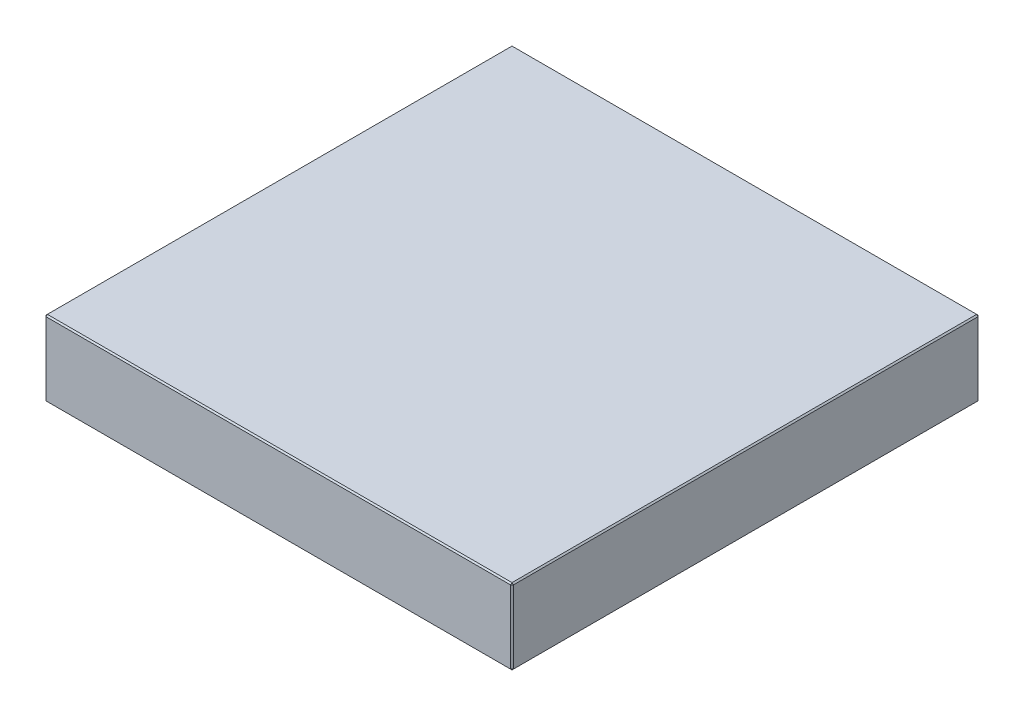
ISO-10303-21;
HEADER;
FILE_DESCRIPTION(('STEP AP214'),'2;1');
FILE_NAME('part.step','',(''),(''),'','','');
FILE_SCHEMA(('AUTOMOTIVE_DESIGN { 1 0 10303 214 1 1 1 1 }'));
ENDSEC;
DATA;
#1=APPLICATION_CONTEXT('core data for automotive mechanical design processes');
#2=APPLICATION_PROTOCOL_DEFINITION('international standard','automotive_design',2000,#1);
#3=PRODUCT_CONTEXT('',#1,'mechanical');
#4=PRODUCT('Part','Part','',(#3));
#5=PRODUCT_RELATED_PRODUCT_CATEGORY('part','',(#4));
#6=PRODUCT_DEFINITION_FORMATION('','',#4);
#7=PRODUCT_DEFINITION_CONTEXT('part definition',#1,'design');
#8=PRODUCT_DEFINITION('design','',#6,#7);
#9=PRODUCT_DEFINITION_SHAPE('','',#8);
#10=(LENGTH_UNIT() NAMED_UNIT(*) SI_UNIT(.MILLI.,.METRE.));
#11=(NAMED_UNIT(*) PLANE_ANGLE_UNIT() SI_UNIT($,.RADIAN.));
#12=(NAMED_UNIT(*) SI_UNIT($,.STERADIAN.) SOLID_ANGLE_UNIT());
#13=UNCERTAINTY_MEASURE_WITH_UNIT(LENGTH_MEASURE(1.E-05),#10,'distance_accuracy_value','');
#14=(GEOMETRIC_REPRESENTATION_CONTEXT(3) GLOBAL_UNCERTAINTY_ASSIGNED_CONTEXT((#13)) GLOBAL_UNIT_ASSIGNED_CONTEXT((#10,
#11,#12)) REPRESENTATION_CONTEXT('',''));
#15=CARTESIAN_POINT('',(0.,0.,0.));
#16=DIRECTION('',(0.,0.,1.));
#17=DIRECTION('',(1.,0.,0.));
#18=AXIS2_PLACEMENT_3D('',#15,#16,#17);
#19=CARTESIAN_POINT('',(-173.,56.,173.));
#20=DIRECTION('',(1.,0.,0.));
#21=DIRECTION('',(0.,0.,-1.));
#22=AXIS2_PLACEMENT_3D('',#19,#20,#21);
#23=PLANE('',#22);
#24=DIRECTION('',(0.,-1.,0.));
#25=VECTOR('',#24,1.);
#26=CARTESIAN_POINT('',(-173.,56.,-172.));
#27=LINE('',#26,#25);
#28=CARTESIAN_POINT('',(-173.,55.,-172.));
#29=VERTEX_POINT('',#28);
#30=CARTESIAN_POINT('',(-173.,1.,-172.));
#31=VERTEX_POINT('',#30);
#32=EDGE_CURVE('E114',#29,#31,#27,.T.);
#33=ORIENTED_EDGE('',*,*,#32,.T.);
#34=DIRECTION('',(0.,0.,1.));
#35=VECTOR('',#34,1.);
#36=CARTESIAN_POINT('',(-173.,1.,173.));
#37=LINE('',#36,#35);
#38=CARTESIAN_POINT('',(-173.,1.,172.));
#39=VERTEX_POINT('',#38);
#40=EDGE_CURVE('E110',#31,#39,#37,.T.);
#41=ORIENTED_EDGE('',*,*,#40,.T.);
#42=DIRECTION('',(0.,1.,0.));
#43=VECTOR('',#42,1.);
#44=CARTESIAN_POINT('',(-173.,56.,172.));
#45=LINE('',#44,#43);
#46=CARTESIAN_POINT('',(-173.,55.,172.));
#47=VERTEX_POINT('',#46);
#48=EDGE_CURVE('E103',#39,#47,#45,.T.);
#49=ORIENTED_EDGE('',*,*,#48,.T.);
#50=DIRECTION('',(0.,0.,-1.));
#51=VECTOR('',#50,1.);
#52=CARTESIAN_POINT('',(-173.,55.,-173.));
#53=LINE('',#52,#51);
#54=EDGE_CURVE('E107',#47,#29,#53,.T.);
#55=ORIENTED_EDGE('',*,*,#54,.T.);
#56=EDGE_LOOP('',(#33,#41,#49,#55));
#57=FACE_BOUND('',#56,.T.);
#58=ADVANCED_FACE('F15',(#57),#23,.F.);
#59=CARTESIAN_POINT('',(173.,56.,173.));
#60=DIRECTION('',(0.,0.,-1.));
#61=DIRECTION('',(-1.,0.,0.));
#62=AXIS2_PLACEMENT_3D('',#59,#60,#61);
#63=PLANE('',#62);
#64=DIRECTION('',(-1.,0.,0.));
#65=VECTOR('',#64,1.);
#66=CARTESIAN_POINT('',(-173.,55.,173.));
#67=LINE('',#66,#65);
#68=CARTESIAN_POINT('',(172.,55.,173.));
#69=VERTEX_POINT('',#68);
#70=CARTESIAN_POINT('',(-172.,55.,173.));
#71=VERTEX_POINT('',#70);
#72=EDGE_CURVE('E164',#69,#71,#67,.T.);
#73=ORIENTED_EDGE('',*,*,#72,.T.);
#74=DIRECTION('',(0.,-1.,0.));
#75=VECTOR('',#74,1.);
#76=CARTESIAN_POINT('',(-172.,56.,173.));
#77=LINE('',#76,#75);
#78=CARTESIAN_POINT('',(-172.,1.,173.));
#79=VERTEX_POINT('',#78);
#80=EDGE_CURVE('E122',#71,#79,#77,.T.);
#81=ORIENTED_EDGE('',*,*,#80,.T.);
#82=DIRECTION('',(1.,0.,0.));
#83=VECTOR('',#82,1.);
#84=CARTESIAN_POINT('',(173.,1.,173.));
#85=LINE('',#84,#83);
#86=CARTESIAN_POINT('',(172.,1.,173.));
#87=VERTEX_POINT('',#86);
#88=EDGE_CURVE('E168',#79,#87,#85,.T.);
#89=ORIENTED_EDGE('',*,*,#88,.T.);
#90=DIRECTION('',(0.,1.,0.));
#91=VECTOR('',#90,1.);
#92=CARTESIAN_POINT('',(172.,56.,173.));
#93=LINE('',#92,#91);
#94=EDGE_CURVE('E166',#87,#69,#93,.T.);
#95=ORIENTED_EDGE('',*,*,#94,.T.);
#96=EDGE_LOOP('',(#73,#81,#89,#95));
#97=FACE_BOUND('',#96,.T.);
#98=ADVANCED_FACE('F275',(#97),#63,.F.);
#99=CARTESIAN_POINT('',(173.,56.,173.));
#100=DIRECTION('',(-1.,0.,0.));
#101=DIRECTION('',(0.,0.,1.));
#102=AXIS2_PLACEMENT_3D('',#99,#100,#101);
#103=PLANE('',#102);
#104=DIRECTION('',(0.,0.,-1.));
#105=VECTOR('',#104,1.);
#106=CARTESIAN_POINT('',(173.,1.,173.));
#107=LINE('',#106,#105);
#108=CARTESIAN_POINT('',(173.,1.,172.));
#109=VERTEX_POINT('',#108);
#110=CARTESIAN_POINT('',(173.,1.,-172.));
#111=VERTEX_POINT('',#110);
#112=EDGE_CURVE('E159',#109,#111,#107,.T.);
#113=ORIENTED_EDGE('',*,*,#112,.T.);
#114=DIRECTION('',(0.,1.,0.));
#115=VECTOR('',#114,1.);
#116=CARTESIAN_POINT('',(173.,56.,-172.));
#117=LINE('',#116,#115);
#118=CARTESIAN_POINT('',(173.,55.,-172.));
#119=VERTEX_POINT('',#118);
#120=EDGE_CURVE('E161',#111,#119,#117,.T.);
#121=ORIENTED_EDGE('',*,*,#120,.T.);
#122=DIRECTION('',(0.,0.,1.));
#123=VECTOR('',#122,1.);
#124=CARTESIAN_POINT('',(173.,55.,173.));
#125=LINE('',#124,#123);
#126=CARTESIAN_POINT('',(173.,55.,172.));
#127=VERTEX_POINT('',#126);
#128=EDGE_CURVE('E155',#119,#127,#125,.T.);
#129=ORIENTED_EDGE('',*,*,#128,.T.);
#130=DIRECTION('',(0.,-1.,0.));
#131=VECTOR('',#130,1.);
#132=CARTESIAN_POINT('',(173.,56.,172.));
#133=LINE('',#132,#131);
#134=EDGE_CURVE('E157',#127,#109,#133,.T.);
#135=ORIENTED_EDGE('',*,*,#134,.T.);
#136=EDGE_LOOP('',(#113,#121,#129,#135));
#137=FACE_BOUND('',#136,.T.);
#138=ADVANCED_FACE('F254',(#137),#103,.F.);
#139=CARTESIAN_POINT('',(173.,56.,-173.));
#140=DIRECTION('',(0.,0.,1.));
#141=DIRECTION('',(1.,0.,0.));
#142=AXIS2_PLACEMENT_3D('',#139,#140,#141);
#143=PLANE('',#142);
#144=DIRECTION('',(0.,-1.,0.));
#145=VECTOR('',#144,1.);
#146=CARTESIAN_POINT('',(172.,56.,-173.));
#147=LINE('',#146,#145);
#148=CARTESIAN_POINT('',(172.,55.,-173.));
#149=VERTEX_POINT('',#148);
#150=CARTESIAN_POINT('',(172.,1.,-173.));
#151=VERTEX_POINT('',#150);
#152=EDGE_CURVE('E148',#149,#151,#147,.T.);
#153=ORIENTED_EDGE('',*,*,#152,.T.);
#154=DIRECTION('',(-1.,0.,0.));
#155=VECTOR('',#154,1.);
#156=CARTESIAN_POINT('',(173.,1.,-173.));
#157=LINE('',#156,#155);
#158=CARTESIAN_POINT('',(-172.,1.,-173.));
#159=VERTEX_POINT('',#158);
#160=EDGE_CURVE('E153',#151,#159,#157,.T.);
#161=ORIENTED_EDGE('',*,*,#160,.T.);
#162=DIRECTION('',(0.,1.,0.));
#163=VECTOR('',#162,1.);
#164=CARTESIAN_POINT('',(-172.,56.,-173.));
#165=LINE('',#164,#163);
#166=CARTESIAN_POINT('',(-172.,55.,-173.));
#167=VERTEX_POINT('',#166);
#168=EDGE_CURVE('E150',#159,#167,#165,.T.);
#169=ORIENTED_EDGE('',*,*,#168,.T.);
#170=DIRECTION('',(1.,0.,0.));
#171=VECTOR('',#170,1.);
#172=CARTESIAN_POINT('',(173.,55.,-173.));
#173=LINE('',#172,#171);
#174=EDGE_CURVE('E146',#167,#149,#173,.T.);
#175=ORIENTED_EDGE('',*,*,#174,.T.);
#176=EDGE_LOOP('',(#153,#161,#169,#175));
#177=FACE_BOUND('',#176,.T.);
#178=ADVANCED_FACE('F284',(#177),#143,.F.);
#179=CARTESIAN_POINT('',(0.,56.,0.));
#180=DIRECTION('',(0.,1.,0.));
#181=DIRECTION('',(0.,0.,1.));
#182=AXIS2_PLACEMENT_3D('',#179,#180,#181);
#183=PLANE('',#182);
#184=DIRECTION('',(0.,0.,-1.));
#185=VECTOR('',#184,1.);
#186=CARTESIAN_POINT('',(172.,56.,-173.));
#187=LINE('',#186,#185);
#188=CARTESIAN_POINT('',(172.,56.,172.));
#189=VERTEX_POINT('',#188);
#190=CARTESIAN_POINT('',(172.,56.,-172.));
#191=VERTEX_POINT('',#190);
#192=EDGE_CURVE('E24',#189,#191,#187,.T.);
#193=ORIENTED_EDGE('',*,*,#192,.T.);
#194=DIRECTION('',(-1.,0.,0.));
#195=VECTOR('',#194,1.);
#196=CARTESIAN_POINT('',(-173.,56.,-172.));
#197=LINE('',#196,#195);
#198=CARTESIAN_POINT('',(-172.,56.,-172.));
#199=VERTEX_POINT('',#198);
#200=EDGE_CURVE('E9',#191,#199,#197,.T.);
#201=ORIENTED_EDGE('',*,*,#200,.T.);
#202=DIRECTION('',(0.,0.,1.));
#203=VECTOR('',#202,1.);
#204=CARTESIAN_POINT('',(-172.,56.,173.));
#205=LINE('',#204,#203);
#206=CARTESIAN_POINT('',(-172.,56.,172.));
#207=VERTEX_POINT('',#206);
#208=EDGE_CURVE('E180',#199,#207,#205,.T.);
#209=ORIENTED_EDGE('',*,*,#208,.T.);
#210=DIRECTION('',(1.,0.,0.));
#211=VECTOR('',#210,1.);
#212=CARTESIAN_POINT('',(173.,56.,172.));
#213=LINE('',#212,#211);
#214=EDGE_CURVE('E35',#207,#189,#213,.T.);
#215=ORIENTED_EDGE('',*,*,#214,.T.);
#216=EDGE_LOOP('',(#193,#201,#209,#215));
#217=FACE_BOUND('',#216,.T.);
#218=ADVANCED_FACE('F350',(#217),#183,.T.);
#219=CARTESIAN_POINT('',(0.,0.,0.));
#220=DIRECTION('',(0.,1.,0.));
#221=DIRECTION('',(0.,0.,1.));
#222=AXIS2_PLACEMENT_3D('',#219,#220,#221);
#223=PLANE('',#222);
#224=DIRECTION('',(0.,0.,1.));
#225=VECTOR('',#224,1.);
#226=CARTESIAN_POINT('',(172.,0.,0.));
#227=LINE('',#226,#225);
#228=CARTESIAN_POINT('',(172.,0.,-172.));
#229=VERTEX_POINT('',#228);
#230=CARTESIAN_POINT('',(172.,0.,172.));
#231=VERTEX_POINT('',#230);
#232=EDGE_CURVE('E171',#229,#231,#227,.T.);
#233=ORIENTED_EDGE('',*,*,#232,.T.);
#234=DIRECTION('',(-1.,0.,0.));
#235=VECTOR('',#234,1.);
#236=CARTESIAN_POINT('',(0.,0.,172.));
#237=LINE('',#236,#235);
#238=CARTESIAN_POINT('',(-172.,0.,172.));
#239=VERTEX_POINT('',#238);
#240=EDGE_CURVE('E177',#231,#239,#237,.T.);
#241=ORIENTED_EDGE('',*,*,#240,.T.);
#242=DIRECTION('',(0.,0.,-1.));
#243=VECTOR('',#242,1.);
#244=CARTESIAN_POINT('',(-172.,0.,0.));
#245=LINE('',#244,#243);
#246=CARTESIAN_POINT('',(-172.,0.,-172.));
#247=VERTEX_POINT('',#246);
#248=EDGE_CURVE('E175',#239,#247,#245,.T.);
#249=ORIENTED_EDGE('',*,*,#248,.T.);
#250=DIRECTION('',(1.,0.,0.));
#251=VECTOR('',#250,1.);
#252=CARTESIAN_POINT('',(0.,0.,-172.));
#253=LINE('',#252,#251);
#254=EDGE_CURVE('E173',#247,#229,#253,.T.);
#255=ORIENTED_EDGE('',*,*,#254,.T.);
#256=EDGE_LOOP('',(#233,#241,#249,#255));
#257=FACE_BOUND('',#256,.T.);
#258=ADVANCED_FACE('F246',(#257),#223,.F.);
#259=CARTESIAN_POINT('',(173.,56.,172.));
#260=DIRECTION('',(-0.707106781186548,0.,-0.707106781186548));
#261=DIRECTION('',(0.,-1.,0.));
#262=AXIS2_PLACEMENT_3D('',#259,#260,#261);
#263=PLANE('',#262);
#264=DIRECTION('',(-0.707106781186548,0.,0.707106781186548));
#265=VECTOR('',#264,1.);
#266=CARTESIAN_POINT('',(172.,55.,173.));
#267=LINE('',#266,#265);
#268=EDGE_CURVE('E19',#69,#127,#267,.F.);
#269=ORIENTED_EDGE('',*,*,#268,.F.);
#270=ORIENTED_EDGE('',*,*,#94,.F.);
#271=DIRECTION('',(0.707106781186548,0.,-0.707106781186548));
#272=VECTOR('',#271,1.);
#273=CARTESIAN_POINT('',(172.,1.,173.));
#274=LINE('',#273,#272);
#275=EDGE_CURVE('E142',#109,#87,#274,.F.);
#276=ORIENTED_EDGE('',*,*,#275,.F.);
#277=ORIENTED_EDGE('',*,*,#134,.F.);
#278=EDGE_LOOP('',(#269,#270,#276,#277));
#279=FACE_BOUND('',#278,.T.);
#280=ADVANCED_FACE('F17',(#279),#263,.F.);
#281=CARTESIAN_POINT('',(172.,55.,173.));
#282=DIRECTION('',(0.577350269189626,0.577350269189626,0.577350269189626));
#283=DIRECTION('',(0.707106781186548,0.,-0.707106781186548));
#284=AXIS2_PLACEMENT_3D('',#281,#282,#283);
#285=PLANE('',#284);
#286=DIRECTION('',(0.,-0.707106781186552,0.707106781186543));
#287=VECTOR('',#286,1.);
#288=CARTESIAN_POINT('',(172.,55.,173.));
#289=LINE('',#288,#287);
#290=EDGE_CURVE('E226',#69,#189,#289,.F.);
#291=ORIENTED_EDGE('',*,*,#290,.F.);
#292=ORIENTED_EDGE('',*,*,#268,.T.);
#293=DIRECTION('',(-0.707106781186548,0.707106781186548,0.));
#294=VECTOR('',#293,1.);
#295=CARTESIAN_POINT('',(172.5,55.5,172.));
#296=LINE('',#295,#294);
#297=EDGE_CURVE('E228',#189,#127,#296,.F.);
#298=ORIENTED_EDGE('',*,*,#297,.F.);
#299=EDGE_LOOP('',(#291,#292,#298));
#300=FACE_BOUND('',#299,.T.);
#301=ADVANCED_FACE('F270',(#300),#285,.T.);
#302=CARTESIAN_POINT('',(172.,1.,173.));
#303=DIRECTION('',(0.577350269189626,-0.577350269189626,0.577350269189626));
#304=DIRECTION('',(0.707106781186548,0.,-0.707106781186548));
#305=AXIS2_PLACEMENT_3D('',#302,#303,#304);
#306=PLANE('',#305);
#307=DIRECTION('',(-0.707106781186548,-0.707106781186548,0.));
#308=VECTOR('',#307,1.);
#309=CARTESIAN_POINT('',(172.5,0.5,172.));
#310=LINE('',#309,#308);
#311=EDGE_CURVE('E220',#109,#231,#310,.T.);
#312=ORIENTED_EDGE('',*,*,#311,.F.);
#313=ORIENTED_EDGE('',*,*,#275,.T.);
#314=DIRECTION('',(0.,0.707106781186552,0.707106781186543));
#315=VECTOR('',#314,1.);
#316=CARTESIAN_POINT('',(172.,1.,173.));
#317=LINE('',#316,#315);
#318=EDGE_CURVE('E223',#231,#87,#317,.T.);
#319=ORIENTED_EDGE('',*,*,#318,.F.);
#320=EDGE_LOOP('',(#312,#313,#319));
#321=FACE_BOUND('',#320,.T.);
#322=ADVANCED_FACE('F235',(#321),#306,.T.);
#323=CARTESIAN_POINT('',(172.,56.,0.));
#324=DIRECTION('',(0.707106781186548,0.707106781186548,0.));
#325=DIRECTION('',(0.,0.,1.));
#326=AXIS2_PLACEMENT_3D('',#323,#324,#325);
#327=PLANE('',#326);
#328=ORIENTED_EDGE('',*,*,#297,.T.);
#329=ORIENTED_EDGE('',*,*,#128,.F.);
#330=DIRECTION('',(0.707106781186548,-0.707106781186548,0.));
#331=VECTOR('',#330,1.);
#332=CARTESIAN_POINT('',(173.,55.,-172.));
#333=LINE('',#332,#331);
#334=EDGE_CURVE('E215',#191,#119,#333,.T.);
#335=ORIENTED_EDGE('',*,*,#334,.F.);
#336=ORIENTED_EDGE('',*,*,#192,.F.);
#337=EDGE_LOOP('',(#328,#329,#335,#336));
#338=FACE_BOUND('',#337,.T.);
#339=ADVANCED_FACE('F265',(#338),#327,.T.);
#340=CARTESIAN_POINT('',(0.,56.,172.));
#341=DIRECTION('',(0.,0.707106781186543,0.707106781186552));
#342=DIRECTION('',(-1.,0.,0.));
#343=AXIS2_PLACEMENT_3D('',#340,#341,#342);
#344=PLANE('',#343);
#345=ORIENTED_EDGE('',*,*,#290,.T.);
#346=ORIENTED_EDGE('',*,*,#214,.F.);
#347=DIRECTION('',(0.,0.707106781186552,-0.707106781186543));
#348=VECTOR('',#347,1.);
#349=CARTESIAN_POINT('',(-172.,55.5,172.5));
#350=LINE('',#349,#348);
#351=EDGE_CURVE('E126',#71,#207,#350,.T.);
#352=ORIENTED_EDGE('',*,*,#351,.F.);
#353=ORIENTED_EDGE('',*,*,#72,.F.);
#354=EDGE_LOOP('',(#345,#346,#352,#353));
#355=FACE_BOUND('',#354,.T.);
#356=ADVANCED_FACE('F273',(#355),#344,.T.);
#357=CARTESIAN_POINT('',(-172.,56.,173.));
#358=DIRECTION('',(0.707106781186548,0.,-0.707106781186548));
#359=DIRECTION('',(0.,-1.,0.));
#360=AXIS2_PLACEMENT_3D('',#357,#358,#359);
#361=PLANE('',#360);
#362=DIRECTION('',(0.707106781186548,0.,0.707106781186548));
#363=VECTOR('',#362,1.);
#364=CARTESIAN_POINT('',(-172.,1.,173.));
#365=LINE('',#364,#363);
#366=EDGE_CURVE('E127',#79,#39,#365,.F.);
#367=ORIENTED_EDGE('',*,*,#366,.F.);
#368=ORIENTED_EDGE('',*,*,#80,.F.);
#369=DIRECTION('',(-0.707106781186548,0.,-0.707106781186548));
#370=VECTOR('',#369,1.);
#371=CARTESIAN_POINT('',(-173.,55.,172.));
#372=LINE('',#371,#370);
#373=EDGE_CURVE('E118',#47,#71,#372,.F.);
#374=ORIENTED_EDGE('',*,*,#373,.F.);
#375=ORIENTED_EDGE('',*,*,#48,.F.);
#376=EDGE_LOOP('',(#367,#368,#374,#375));
#377=FACE_BOUND('',#376,.T.);
#378=ADVANCED_FACE('F120',(#377),#361,.F.);
#379=CARTESIAN_POINT('',(173.,1.,173.));
#380=DIRECTION('',(0.,0.707106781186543,-0.707106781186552));
#381=DIRECTION('',(1.,0.,0.));
#382=AXIS2_PLACEMENT_3D('',#379,#380,#381);
#383=PLANE('',#382);
#384=ORIENTED_EDGE('',*,*,#318,.T.);
#385=ORIENTED_EDGE('',*,*,#88,.F.);
#386=DIRECTION('',(0.,-0.707106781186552,-0.707106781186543));
#387=VECTOR('',#386,1.);
#388=CARTESIAN_POINT('',(-172.,1.,173.));
#389=LINE('',#388,#387);
#390=EDGE_CURVE('E211',#239,#79,#389,.F.);
#391=ORIENTED_EDGE('',*,*,#390,.F.);
#392=ORIENTED_EDGE('',*,*,#240,.F.);
#393=EDGE_LOOP('',(#384,#385,#391,#392));
#394=FACE_BOUND('',#393,.T.);
#395=ADVANCED_FACE('F243',(#394),#383,.F.);
#396=CARTESIAN_POINT('',(173.,1.,173.));
#397=DIRECTION('',(-0.707106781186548,0.707106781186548,0.));
#398=DIRECTION('',(0.,0.,-1.));
#399=AXIS2_PLACEMENT_3D('',#396,#397,#398);
#400=PLANE('',#399);
#401=ORIENTED_EDGE('',*,*,#311,.T.);
#402=ORIENTED_EDGE('',*,*,#232,.F.);
#403=DIRECTION('',(0.707106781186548,0.707106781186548,0.));
#404=VECTOR('',#403,1.);
#405=CARTESIAN_POINT('',(172.5,0.499999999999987,-172.));
#406=LINE('',#405,#404);
#407=EDGE_CURVE('E208',#111,#229,#406,.F.);
#408=ORIENTED_EDGE('',*,*,#407,.F.);
#409=ORIENTED_EDGE('',*,*,#112,.F.);
#410=EDGE_LOOP('',(#401,#402,#408,#409));
#411=FACE_BOUND('',#410,.T.);
#412=ADVANCED_FACE('F251',(#411),#400,.F.);
#413=CARTESIAN_POINT('',(172.,56.,-173.));
#414=DIRECTION('',(-0.707106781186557,0.,0.707106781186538));
#415=DIRECTION('',(0.,-1.,0.));
#416=AXIS2_PLACEMENT_3D('',#413,#414,#415);
#417=PLANE('',#416);
#418=DIRECTION('',(0.707106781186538,0.,0.707106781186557));
#419=VECTOR('',#418,1.);
#420=CARTESIAN_POINT('',(173.,55.,-172.));
#421=LINE('',#420,#419);
#422=EDGE_CURVE('E217',#119,#149,#421,.F.);
#423=ORIENTED_EDGE('',*,*,#422,.F.);
#424=ORIENTED_EDGE('',*,*,#120,.F.);
#425=DIRECTION('',(-0.707106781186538,0.,-0.707106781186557));
#426=VECTOR('',#425,1.);
#427=CARTESIAN_POINT('',(172.,1.,-173.));
#428=LINE('',#427,#426);
#429=EDGE_CURVE('E205',#151,#111,#428,.F.);
#430=ORIENTED_EDGE('',*,*,#429,.F.);
#431=ORIENTED_EDGE('',*,*,#152,.F.);
#432=EDGE_LOOP('',(#423,#424,#430,#431));
#433=FACE_BOUND('',#432,.T.);
#434=ADVANCED_FACE('F258',(#433),#417,.F.);
#435=CARTESIAN_POINT('',(173.,55.,-172.));
#436=DIRECTION('',(0.577350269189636,0.57735026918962,-0.57735026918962));
#437=DIRECTION('',(-0.707106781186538,0.,-0.707106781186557));
#438=AXIS2_PLACEMENT_3D('',#435,#436,#437);
#439=PLANE('',#438);
#440=ORIENTED_EDGE('',*,*,#334,.T.);
#441=ORIENTED_EDGE('',*,*,#422,.T.);
#442=DIRECTION('',(0.,0.707106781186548,0.707106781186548));
#443=VECTOR('',#442,1.);
#444=CARTESIAN_POINT('',(172.,55.5,-172.5));
#445=LINE('',#444,#443);
#446=EDGE_CURVE('E134',#191,#149,#445,.F.);
#447=ORIENTED_EDGE('',*,*,#446,.F.);
#448=EDGE_LOOP('',(#440,#441,#447));
#449=FACE_BOUND('',#448,.T.);
#450=ADVANCED_FACE('F325',(#449),#439,.T.);
#451=CARTESIAN_POINT('',(-173.,55.,172.));
#452=DIRECTION('',(-0.577350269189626,0.577350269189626,0.577350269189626));
#453=DIRECTION('',(0.707106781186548,0.,0.707106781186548));
#454=AXIS2_PLACEMENT_3D('',#451,#452,#453);
#455=PLANE('',#454);
#456=ORIENTED_EDGE('',*,*,#373,.T.);
#457=ORIENTED_EDGE('',*,*,#351,.T.);
#458=DIRECTION('',(-0.707106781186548,-0.707106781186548,0.));
#459=VECTOR('',#458,1.);
#460=CARTESIAN_POINT('',(-173.,55.,172.));
#461=LINE('',#460,#459);
#462=EDGE_CURVE('E130',#47,#207,#461,.F.);
#463=ORIENTED_EDGE('',*,*,#462,.F.);
#464=EDGE_LOOP('',(#456,#457,#463));
#465=FACE_BOUND('',#464,.T.);
#466=ADVANCED_FACE('F131',(#465),#455,.T.);
#467=CARTESIAN_POINT('',(-172.,1.,173.));
#468=DIRECTION('',(-0.577350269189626,-0.577350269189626,0.577350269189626));
#469=DIRECTION('',(0.707106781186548,0.,0.707106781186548));
#470=AXIS2_PLACEMENT_3D('',#467,#468,#469);
#471=PLANE('',#470);
#472=ORIENTED_EDGE('',*,*,#390,.T.);
#473=ORIENTED_EDGE('',*,*,#366,.T.);
#474=DIRECTION('',(-0.707106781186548,0.707106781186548,0.));
#475=VECTOR('',#474,1.);
#476=CARTESIAN_POINT('',(-172.5,0.5,172.));
#477=LINE('',#476,#475);
#478=EDGE_CURVE('E135',#239,#39,#477,.T.);
#479=ORIENTED_EDGE('',*,*,#478,.F.);
#480=EDGE_LOOP('',(#472,#473,#479));
#481=FACE_BOUND('',#480,.T.);
#482=ADVANCED_FACE('F318',(#481),#471,.T.);
#483=CARTESIAN_POINT('',(172.,1.,-173.));
#484=DIRECTION('',(0.577350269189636,-0.57735026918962,-0.57735026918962));
#485=DIRECTION('',(-0.707106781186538,0.,-0.707106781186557));
#486=AXIS2_PLACEMENT_3D('',#483,#484,#485);
#487=PLANE('',#486);
#488=ORIENTED_EDGE('',*,*,#429,.T.);
#489=ORIENTED_EDGE('',*,*,#407,.T.);
#490=DIRECTION('',(0.,-0.707106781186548,0.707106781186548));
#491=VECTOR('',#490,1.);
#492=CARTESIAN_POINT('',(172.,1.,-173.));
#493=LINE('',#492,#491);
#494=EDGE_CURVE('E198',#151,#229,#493,.T.);
#495=ORIENTED_EDGE('',*,*,#494,.F.);
#496=EDGE_LOOP('',(#488,#489,#495));
#497=FACE_BOUND('',#496,.T.);
#498=ADVANCED_FACE('F314',(#497),#487,.T.);
#499=CARTESIAN_POINT('',(0.,56.,-172.));
#500=DIRECTION('',(0.,0.707106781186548,-0.707106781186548));
#501=DIRECTION('',(1.,0.,0.));
#502=AXIS2_PLACEMENT_3D('',#499,#500,#501);
#503=PLANE('',#502);
#504=ORIENTED_EDGE('',*,*,#446,.T.);
#505=ORIENTED_EDGE('',*,*,#174,.F.);
#506=DIRECTION('',(0.,-0.707106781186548,-0.707106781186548));
#507=VECTOR('',#506,1.);
#508=CARTESIAN_POINT('',(-172.,55.,-173.));
#509=LINE('',#508,#507);
#510=EDGE_CURVE('E195',#199,#167,#509,.T.);
#511=ORIENTED_EDGE('',*,*,#510,.F.);
#512=ORIENTED_EDGE('',*,*,#200,.F.);
#513=EDGE_LOOP('',(#504,#505,#511,#512));
#514=FACE_BOUND('',#513,.T.);
#515=ADVANCED_FACE('F311',(#514),#503,.T.);
#516=CARTESIAN_POINT('',(-172.,56.,0.));
#517=DIRECTION('',(-0.707106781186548,0.707106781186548,0.));
#518=DIRECTION('',(0.,0.,-1.));
#519=AXIS2_PLACEMENT_3D('',#516,#517,#518);
#520=PLANE('',#519);
#521=ORIENTED_EDGE('',*,*,#462,.T.);
#522=ORIENTED_EDGE('',*,*,#208,.F.);
#523=DIRECTION('',(0.707106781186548,0.707106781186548,0.));
#524=VECTOR('',#523,1.);
#525=CARTESIAN_POINT('',(-172.5,55.5,-172.));
#526=LINE('',#525,#524);
#527=EDGE_CURVE('E138',#29,#199,#526,.T.);
#528=ORIENTED_EDGE('',*,*,#527,.F.);
#529=ORIENTED_EDGE('',*,*,#54,.F.);
#530=EDGE_LOOP('',(#521,#522,#528,#529));
#531=FACE_BOUND('',#530,.T.);
#532=ADVANCED_FACE('F137',(#531),#520,.T.);
#533=CARTESIAN_POINT('',(-173.,1.,173.));
#534=DIRECTION('',(0.707106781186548,0.707106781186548,0.));
#535=DIRECTION('',(0.,0.,1.));
#536=AXIS2_PLACEMENT_3D('',#533,#534,#535);
#537=PLANE('',#536);
#538=ORIENTED_EDGE('',*,*,#478,.T.);
#539=ORIENTED_EDGE('',*,*,#40,.F.);
#540=DIRECTION('',(0.707106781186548,-0.707106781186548,0.));
#541=VECTOR('',#540,1.);
#542=CARTESIAN_POINT('',(-173.,1.,-172.));
#543=LINE('',#542,#541);
#544=EDGE_CURVE('E191',#247,#31,#543,.F.);
#545=ORIENTED_EDGE('',*,*,#544,.F.);
#546=ORIENTED_EDGE('',*,*,#248,.F.);
#547=EDGE_LOOP('',(#538,#539,#545,#546));
#548=FACE_BOUND('',#547,.T.);
#549=ADVANCED_FACE('F304',(#548),#537,.F.);
#550=CARTESIAN_POINT('',(173.,1.,-173.));
#551=DIRECTION('',(0.,0.707106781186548,0.707106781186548));
#552=DIRECTION('',(-1.,0.,0.));
#553=AXIS2_PLACEMENT_3D('',#550,#551,#552);
#554=PLANE('',#553);
#555=ORIENTED_EDGE('',*,*,#494,.T.);
#556=ORIENTED_EDGE('',*,*,#254,.F.);
#557=DIRECTION('',(0.,0.707106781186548,-0.707106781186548));
#558=VECTOR('',#557,1.);
#559=CARTESIAN_POINT('',(-172.,0.5,-172.5));
#560=LINE('',#559,#558);
#561=EDGE_CURVE('E188',#159,#247,#560,.F.);
#562=ORIENTED_EDGE('',*,*,#561,.F.);
#563=ORIENTED_EDGE('',*,*,#160,.F.);
#564=EDGE_LOOP('',(#555,#556,#562,#563));
#565=FACE_BOUND('',#564,.T.);
#566=ADVANCED_FACE('F300',(#565),#554,.F.);
#567=CARTESIAN_POINT('',(-172.,55.,-173.));
#568=DIRECTION('',(-0.577350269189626,0.577350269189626,-0.577350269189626));
#569=DIRECTION('',(-0.707106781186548,0.,0.707106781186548));
#570=AXIS2_PLACEMENT_3D('',#567,#568,#569);
#571=PLANE('',#570);
#572=ORIENTED_EDGE('',*,*,#527,.T.);
#573=ORIENTED_EDGE('',*,*,#510,.T.);
#574=DIRECTION('',(0.707106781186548,0.,-0.707106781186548));
#575=VECTOR('',#574,1.);
#576=CARTESIAN_POINT('',(-172.,55.,-173.));
#577=LINE('',#576,#575);
#578=EDGE_CURVE('E186',#29,#167,#577,.T.);
#579=ORIENTED_EDGE('',*,*,#578,.F.);
#580=EDGE_LOOP('',(#572,#573,#579));
#581=FACE_BOUND('',#580,.T.);
#582=ADVANCED_FACE('F296',(#581),#571,.T.);
#583=CARTESIAN_POINT('',(-173.,1.,-172.));
#584=DIRECTION('',(-0.577350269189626,-0.577350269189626,-0.577350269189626));
#585=DIRECTION('',(-0.707106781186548,0.,0.707106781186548));
#586=AXIS2_PLACEMENT_3D('',#583,#584,#585);
#587=PLANE('',#586);
#588=ORIENTED_EDGE('',*,*,#561,.T.);
#589=ORIENTED_EDGE('',*,*,#544,.T.);
#590=DIRECTION('',(-0.707106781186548,0.,0.707106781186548));
#591=VECTOR('',#590,1.);
#592=CARTESIAN_POINT('',(-173.,1.,-172.));
#593=LINE('',#592,#591);
#594=EDGE_CURVE('E184',#159,#31,#593,.T.);
#595=ORIENTED_EDGE('',*,*,#594,.F.);
#596=EDGE_LOOP('',(#588,#589,#595));
#597=FACE_BOUND('',#596,.T.);
#598=ADVANCED_FACE('F292',(#597),#587,.T.);
#599=CARTESIAN_POINT('',(-173.,56.,-172.));
#600=DIRECTION('',(0.707106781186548,0.,0.707106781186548));
#601=DIRECTION('',(0.,-1.,0.));
#602=AXIS2_PLACEMENT_3D('',#599,#600,#601);
#603=PLANE('',#602);
#604=ORIENTED_EDGE('',*,*,#578,.T.);
#605=ORIENTED_EDGE('',*,*,#168,.F.);
#606=ORIENTED_EDGE('',*,*,#594,.T.);
#607=ORIENTED_EDGE('',*,*,#32,.F.);
#608=EDGE_LOOP('',(#604,#605,#606,#607));
#609=FACE_BOUND('',#608,.T.);
#610=ADVANCED_FACE('F289',(#609),#603,.F.);
#611=CLOSED_SHELL('',(#58,#98,#138,#178,#218,#258,#280,#301,#322,#339,#356,#378,#395,#412,#434,
#450,#466,#482,#498,#515,#532,#549,#566,#582,#598,#610));
#612=MANIFOLD_SOLID_BREP('B1',#611);
#613=ADVANCED_BREP_SHAPE_REPRESENTATION('',(#18,#612),#14);
#614=SHAPE_DEFINITION_REPRESENTATION(#9,#613);
ENDSEC;
END-ISO-10303-21;
